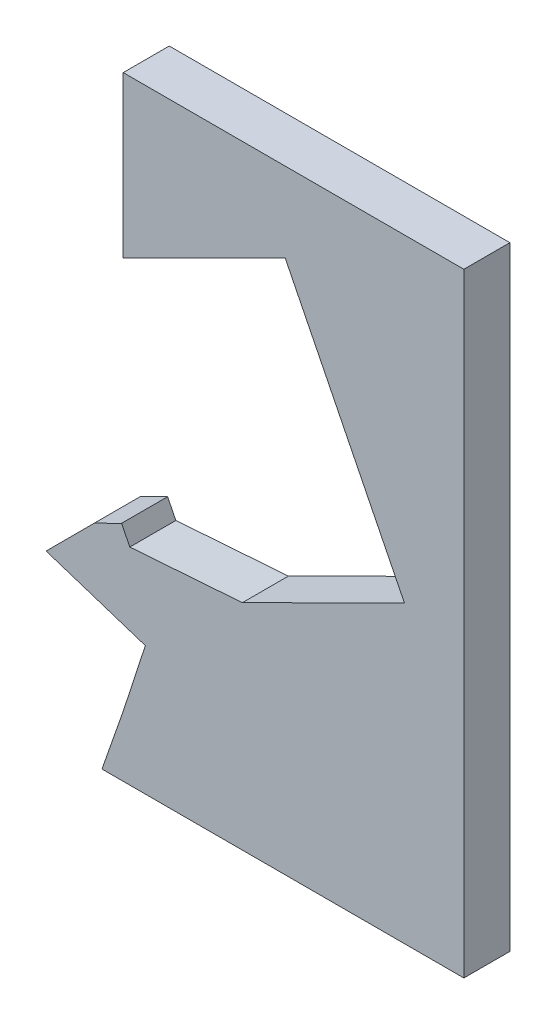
from build123d import *

# Parameters (mm, degrees)
EXTRUDE1_DEPTH = 3.81


with BuildPart() as part:
    # Sketch1 → Extrude1 (new body)
    with BuildSketch(Plane.XY):
        Polygon((-21.672629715, -14.784107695), (-23.451004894, -19.871332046), (6.499168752, -19.871332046), (6.499168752, 30.928667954), (-21.692083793, 30.928667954), (-21.692083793, 17.641024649), (-8.28059745, 24.327745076), (1.579481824, 4.551485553), (-11.832004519, -2.135234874), (-21.147337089, -2.806212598), (-21.827342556, -1.442332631), (-24.100475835, -2.575675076), (-28.074458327, -6.55452384), (-19.863153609, -9.229401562), align=None)
    extrude(amount=EXTRUDE1_DEPTH)


solid = part.part
